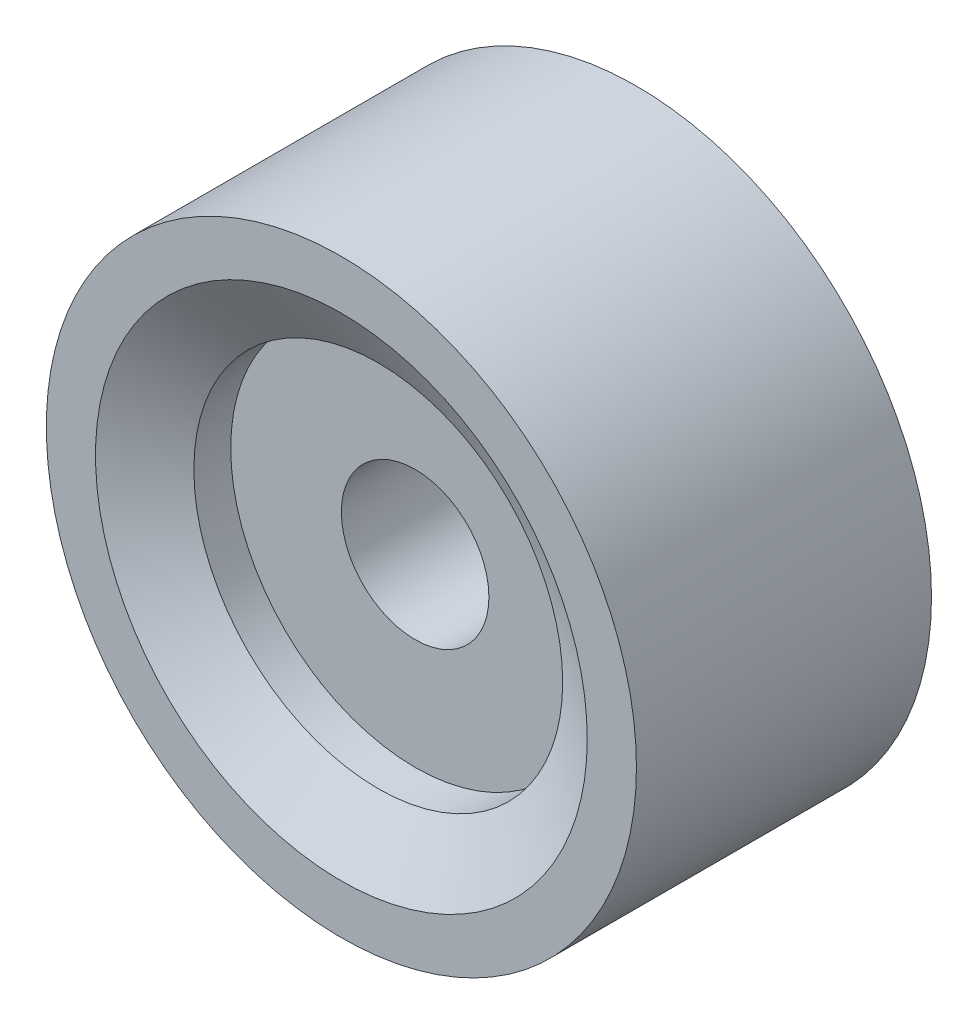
ISO-10303-21;
HEADER;
FILE_DESCRIPTION(('STEP AP214'),'2;1');
FILE_NAME('part.step','',(''),(''),'','','');
FILE_SCHEMA(('AUTOMOTIVE_DESIGN { 1 0 10303 214 1 1 1 1 }'));
ENDSEC;
DATA;
#1=APPLICATION_CONTEXT('core data for automotive mechanical design processes');
#2=APPLICATION_PROTOCOL_DEFINITION('international standard','automotive_design',2000,#1);
#3=PRODUCT_CONTEXT('',#1,'mechanical');
#4=PRODUCT('Part','Part','',(#3));
#5=PRODUCT_RELATED_PRODUCT_CATEGORY('part','',(#4));
#6=PRODUCT_DEFINITION_FORMATION('','',#4);
#7=PRODUCT_DEFINITION_CONTEXT('part definition',#1,'design');
#8=PRODUCT_DEFINITION('design','',#6,#7);
#9=PRODUCT_DEFINITION_SHAPE('','',#8);
#10=(LENGTH_UNIT() NAMED_UNIT(*) SI_UNIT(.MILLI.,.METRE.));
#11=(NAMED_UNIT(*) PLANE_ANGLE_UNIT() SI_UNIT($,.RADIAN.));
#12=(NAMED_UNIT(*) SI_UNIT($,.STERADIAN.) SOLID_ANGLE_UNIT());
#13=UNCERTAINTY_MEASURE_WITH_UNIT(LENGTH_MEASURE(1.E-05),#10,'distance_accuracy_value','');
#14=(GEOMETRIC_REPRESENTATION_CONTEXT(3) GLOBAL_UNCERTAINTY_ASSIGNED_CONTEXT((#13)) GLOBAL_UNIT_ASSIGNED_CONTEXT((#10,
#11,#12)) REPRESENTATION_CONTEXT('',''));
#15=CARTESIAN_POINT('',(0.,0.,0.));
#16=DIRECTION('',(0.,0.,1.));
#17=DIRECTION('',(1.,0.,0.));
#18=AXIS2_PLACEMENT_3D('',#15,#16,#17);
#19=CARTESIAN_POINT('',(0.,0.,6.));
#20=DIRECTION('',(0.,0.,1.));
#21=DIRECTION('',(1.,0.,0.));
#22=AXIS2_PLACEMENT_3D('',#19,#20,#21);
#23=PLANE('',#22);
#24=CARTESIAN_POINT('',(0.,0.,6.));
#25=DIRECTION('',(0.,0.,1.));
#26=DIRECTION('',(1.,0.,0.));
#27=AXIS2_PLACEMENT_3D('',#24,#25,#26);
#28=CIRCLE('',#27,10.);
#29=CARTESIAN_POINT('',(10.,0.,6.));
#30=VERTEX_POINT('',#29);
#31=EDGE_CURVE('E19',#30,#30,#28,.T.);
#32=ORIENTED_EDGE('',*,*,#31,.F.);
#33=EDGE_LOOP('',(#32));
#34=FACE_BOUND('',#33,.T.);
#35=CARTESIAN_POINT('',(0.,0.,6.));
#36=DIRECTION('',(0.,0.,1.));
#37=DIRECTION('',(1.,0.,0.));
#38=AXIS2_PLACEMENT_3D('',#35,#36,#37);
#39=CIRCLE('',#38,12.);
#40=CARTESIAN_POINT('',(12.,0.,6.));
#41=VERTEX_POINT('',#40);
#42=EDGE_CURVE('E45',#41,#41,#39,.T.);
#43=ORIENTED_EDGE('',*,*,#42,.T.);
#44=EDGE_LOOP('',(#43));
#45=FACE_BOUND('',#44,.T.);
#46=ADVANCED_FACE('F12',(#34,#45),#23,.T.);
#47=CARTESIAN_POINT('',(0.,0.,-6.));
#48=DIRECTION('',(0.,0.,1.));
#49=DIRECTION('',(1.,0.,0.));
#50=AXIS2_PLACEMENT_3D('',#47,#48,#49);
#51=PLANE('',#50);
#52=CARTESIAN_POINT('',(0.,0.,-6.));
#53=DIRECTION('',(0.,0.,-1.));
#54=DIRECTION('',(-1.,0.,0.));
#55=AXIS2_PLACEMENT_3D('',#52,#53,#54);
#56=CIRCLE('',#55,10.);
#57=CARTESIAN_POINT('',(-10.,0.,-6.));
#58=VERTEX_POINT('',#57);
#59=EDGE_CURVE('E8',#58,#58,#56,.T.);
#60=ORIENTED_EDGE('',*,*,#59,.F.);
#61=EDGE_LOOP('',(#60));
#62=FACE_BOUND('',#61,.T.);
#63=CARTESIAN_POINT('',(0.,0.,-6.));
#64=DIRECTION('',(0.,0.,1.));
#65=DIRECTION('',(1.,0.,0.));
#66=AXIS2_PLACEMENT_3D('',#63,#64,#65);
#67=CIRCLE('',#66,12.);
#68=CARTESIAN_POINT('',(12.,0.,-6.));
#69=VERTEX_POINT('',#68);
#70=EDGE_CURVE('E40',#69,#69,#67,.T.);
#71=ORIENTED_EDGE('',*,*,#70,.F.);
#72=EDGE_LOOP('',(#71));
#73=FACE_BOUND('',#72,.T.);
#74=ADVANCED_FACE('F62',(#62,#73),#51,.F.);
#75=CARTESIAN_POINT('',(0.,0.,6.));
#76=DIRECTION('',(0.,0.,-1.));
#77=DIRECTION('',(-1.,0.,0.));
#78=AXIS2_PLACEMENT_3D('',#75,#76,#77);
#79=CYLINDRICAL_SURFACE('',#78,3.);
#80=CARTESIAN_POINT('',(0.,0.,-3.));
#81=DIRECTION('',(0.,0.,-1.));
#82=DIRECTION('',(-1.,0.,0.));
#83=AXIS2_PLACEMENT_3D('',#80,#81,#82);
#84=CIRCLE('',#83,3.);
#85=CARTESIAN_POINT('',(-3.,0.,-3.));
#86=VERTEX_POINT('',#85);
#87=EDGE_CURVE('E28',#86,#86,#84,.F.);
#88=ORIENTED_EDGE('',*,*,#87,.F.);
#89=EDGE_LOOP('',(#88));
#90=FACE_BOUND('',#89,.T.);
#91=CARTESIAN_POINT('',(0.,0.,3.));
#92=DIRECTION('',(0.,0.,1.));
#93=DIRECTION('',(1.,0.,0.));
#94=AXIS2_PLACEMENT_3D('',#91,#92,#93);
#95=CIRCLE('',#94,3.);
#96=CARTESIAN_POINT('',(3.,0.,3.));
#97=VERTEX_POINT('',#96);
#98=EDGE_CURVE('E15',#97,#97,#95,.F.);
#99=ORIENTED_EDGE('',*,*,#98,.F.);
#100=EDGE_LOOP('',(#99));
#101=FACE_BOUND('',#100,.T.);
#102=ADVANCED_FACE('F56',(#90,#101),#79,.F.);
#103=CARTESIAN_POINT('',(0.,0.,-3.));
#104=DIRECTION('',(0.,0.,-1.));
#105=DIRECTION('',(-1.,0.,0.));
#106=AXIS2_PLACEMENT_3D('',#103,#104,#105);
#107=PLANE('',#106);
#108=CARTESIAN_POINT('',(0.,0.,-3.));
#109=DIRECTION('',(0.,0.,1.));
#110=DIRECTION('',(1.,0.,0.));
#111=AXIS2_PLACEMENT_3D('',#108,#109,#110);
#112=CIRCLE('',#111,7.5);
#113=CARTESIAN_POINT('',(7.5,0.,-3.));
#114=VERTEX_POINT('',#113);
#115=EDGE_CURVE('E31',#114,#114,#112,.T.);
#116=ORIENTED_EDGE('',*,*,#115,.F.);
#117=EDGE_LOOP('',(#116));
#118=FACE_BOUND('',#117,.T.);
#119=ORIENTED_EDGE('',*,*,#87,.T.);
#120=EDGE_LOOP('',(#119));
#121=FACE_BOUND('',#120,.T.);
#122=ADVANCED_FACE('F53',(#118,#121),#107,.T.);
#123=CARTESIAN_POINT('',(0.,0.,9.8539660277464));
#124=DIRECTION('',(0.,0.,1.));
#125=DIRECTION('',(1.,0.,0.));
#126=AXIS2_PLACEMENT_3D('',#123,#124,#125);
#127=CYLINDRICAL_SURFACE('',#126,7.5);
#128=CARTESIAN_POINT('',(0.,0.,-4.5));
#129=DIRECTION('',(0.,0.,-1.));
#130=DIRECTION('',(-1.,0.,0.));
#131=AXIS2_PLACEMENT_3D('',#128,#129,#130);
#132=CIRCLE('',#131,7.5);
#133=CARTESIAN_POINT('',(-7.5,0.,-4.5));
#134=VERTEX_POINT('',#133);
#135=EDGE_CURVE('E24',#134,#134,#132,.F.);
#136=ORIENTED_EDGE('',*,*,#135,.F.);
#137=EDGE_LOOP('',(#136));
#138=FACE_BOUND('',#137,.T.);
#139=ORIENTED_EDGE('',*,*,#115,.T.);
#140=EDGE_LOOP('',(#139));
#141=FACE_BOUND('',#140,.T.);
#142=ADVANCED_FACE('F51',(#138,#141),#127,.F.);
#143=CARTESIAN_POINT('',(0.,0.,3.));
#144=DIRECTION('',(0.,0.,1.));
#145=DIRECTION('',(1.,0.,0.));
#146=AXIS2_PLACEMENT_3D('',#143,#144,#145);
#147=PLANE('',#146);
#148=CARTESIAN_POINT('',(0.,0.,3.));
#149=DIRECTION('',(0.,0.,1.));
#150=DIRECTION('',(1.,0.,0.));
#151=AXIS2_PLACEMENT_3D('',#148,#149,#150);
#152=CIRCLE('',#151,7.5);
#153=CARTESIAN_POINT('',(7.5,0.,3.));
#154=VERTEX_POINT('',#153);
#155=EDGE_CURVE('E35',#154,#154,#152,.T.);
#156=ORIENTED_EDGE('',*,*,#155,.T.);
#157=EDGE_LOOP('',(#156));
#158=FACE_BOUND('',#157,.T.);
#159=ORIENTED_EDGE('',*,*,#98,.T.);
#160=EDGE_LOOP('',(#159));
#161=FACE_BOUND('',#160,.T.);
#162=ADVANCED_FACE('F66',(#158,#161),#147,.T.);
#163=CARTESIAN_POINT('',(0.,0.,9.8539660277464));
#164=DIRECTION('',(0.,0.,1.));
#165=DIRECTION('',(1.,0.,0.));
#166=AXIS2_PLACEMENT_3D('',#163,#164,#165);
#167=CYLINDRICAL_SURFACE('',#166,7.5);
#168=CARTESIAN_POINT('',(0.,0.,4.5));
#169=DIRECTION('',(0.,0.,1.));
#170=DIRECTION('',(1.,0.,0.));
#171=AXIS2_PLACEMENT_3D('',#168,#169,#170);
#172=CIRCLE('',#171,7.5);
#173=CARTESIAN_POINT('',(7.5,0.,4.5));
#174=VERTEX_POINT('',#173);
#175=EDGE_CURVE('E33',#174,#174,#172,.F.);
#176=ORIENTED_EDGE('',*,*,#175,.F.);
#177=EDGE_LOOP('',(#176));
#178=FACE_BOUND('',#177,.T.);
#179=ORIENTED_EDGE('',*,*,#155,.F.);
#180=EDGE_LOOP('',(#179));
#181=FACE_BOUND('',#180,.T.);
#182=ADVANCED_FACE('F68',(#178,#181),#167,.F.);
#183=CARTESIAN_POINT('',(0.,0.,6.));
#184=DIRECTION('',(0.,0.,1.));
#185=DIRECTION('',(1.,0.,0.));
#186=AXIS2_PLACEMENT_3D('',#183,#184,#185);
#187=CONICAL_SURFACE('',#186,10.,1.03037682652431);
#188=ORIENTED_EDGE('',*,*,#175,.T.);
#189=EDGE_LOOP('',(#188));
#190=FACE_BOUND('',#189,.T.);
#191=ORIENTED_EDGE('',*,*,#31,.T.);
#192=EDGE_LOOP('',(#191));
#193=FACE_BOUND('',#192,.T.);
#194=ADVANCED_FACE('F76',(#190,#193),#187,.F.);
#195=CARTESIAN_POINT('',(0.,0.,-4.5));
#196=DIRECTION('',(0.,0.,-1.));
#197=DIRECTION('',(-1.,0.,0.));
#198=AXIS2_PLACEMENT_3D('',#195,#196,#197);
#199=CONICAL_SURFACE('',#198,7.5,1.03037682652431);
#200=ORIENTED_EDGE('',*,*,#59,.T.);
#201=EDGE_LOOP('',(#200));
#202=FACE_BOUND('',#201,.T.);
#203=ORIENTED_EDGE('',*,*,#135,.T.);
#204=EDGE_LOOP('',(#203));
#205=FACE_BOUND('',#204,.T.);
#206=ADVANCED_FACE('F96',(#202,#205),#199,.F.);
#207=CARTESIAN_POINT('',(0.,0.,-6.));
#208=DIRECTION('',(0.,0.,1.));
#209=DIRECTION('',(1.,0.,0.));
#210=AXIS2_PLACEMENT_3D('',#207,#208,#209);
#211=CYLINDRICAL_SURFACE('',#210,12.);
#212=ORIENTED_EDGE('',*,*,#70,.T.);
#213=EDGE_LOOP('',(#212));
#214=FACE_BOUND('',#213,.T.);
#215=ORIENTED_EDGE('',*,*,#42,.F.);
#216=EDGE_LOOP('',(#215));
#217=FACE_BOUND('',#216,.T.);
#218=ADVANCED_FACE('F94',(#214,#217),#211,.T.);
#219=CLOSED_SHELL('',(#46,#74,#102,#122,#142,#162,#182,#194,#206,#218));
#220=MANIFOLD_SOLID_BREP('B1',#219);
#221=ADVANCED_BREP_SHAPE_REPRESENTATION('',(#18,#220),#14);
#222=SHAPE_DEFINITION_REPRESENTATION(#9,#221);
ENDSEC;
END-ISO-10303-21;
